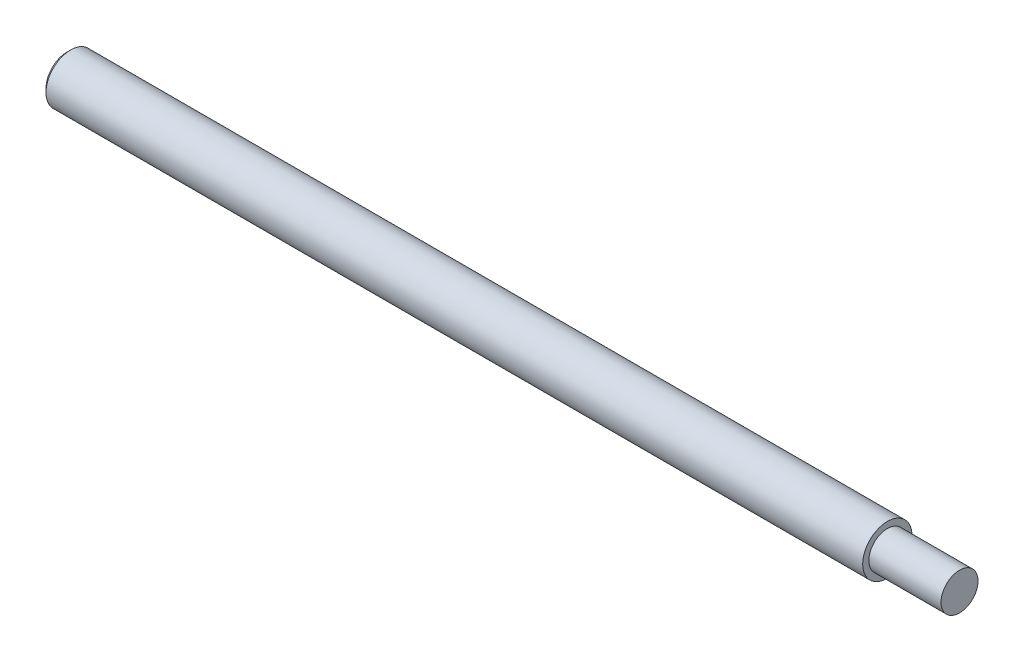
ISO-10303-21;
HEADER;
FILE_DESCRIPTION(('STEP AP214'),'2;1');
FILE_NAME('part.step','',(''),(''),'','','');
FILE_SCHEMA(('AUTOMOTIVE_DESIGN { 1 0 10303 214 1 1 1 1 }'));
ENDSEC;
DATA;
#1=APPLICATION_CONTEXT('core data for automotive mechanical design processes');
#2=APPLICATION_PROTOCOL_DEFINITION('international standard','automotive_design',2000,#1);
#3=PRODUCT_CONTEXT('',#1,'mechanical');
#4=PRODUCT('Part','Part','',(#3));
#5=PRODUCT_RELATED_PRODUCT_CATEGORY('part','',(#4));
#6=PRODUCT_DEFINITION_FORMATION('','',#4);
#7=PRODUCT_DEFINITION_CONTEXT('part definition',#1,'design');
#8=PRODUCT_DEFINITION('design','',#6,#7);
#9=PRODUCT_DEFINITION_SHAPE('','',#8);
#10=(LENGTH_UNIT() NAMED_UNIT(*) SI_UNIT(.MILLI.,.METRE.));
#11=(NAMED_UNIT(*) PLANE_ANGLE_UNIT() SI_UNIT($,.RADIAN.));
#12=(NAMED_UNIT(*) SI_UNIT($,.STERADIAN.) SOLID_ANGLE_UNIT());
#13=UNCERTAINTY_MEASURE_WITH_UNIT(LENGTH_MEASURE(1.E-05),#10,'distance_accuracy_value','');
#14=(GEOMETRIC_REPRESENTATION_CONTEXT(3) GLOBAL_UNCERTAINTY_ASSIGNED_CONTEXT((#13)) GLOBAL_UNIT_ASSIGNED_CONTEXT((#10,
#11,#12)) REPRESENTATION_CONTEXT('',''));
#15=CARTESIAN_POINT('',(0.,0.,0.));
#16=DIRECTION('',(0.,0.,1.));
#17=DIRECTION('',(1.,0.,0.));
#18=AXIS2_PLACEMENT_3D('',#15,#16,#17);
#19=CARTESIAN_POINT('',(0.,0.,0.));
#20=DIRECTION('',(1.,0.,0.));
#21=DIRECTION('',(0.,0.,-1.));
#22=AXIS2_PLACEMENT_3D('',#19,#20,#21);
#23=PLANE('',#22);
#24=CARTESIAN_POINT('',(0.,0.,0.));
#25=DIRECTION('',(1.,0.,0.));
#26=DIRECTION('',(0.,0.,-1.));
#27=AXIS2_PLACEMENT_3D('',#24,#25,#26);
#28=CIRCLE('',#27,17.);
#29=CARTESIAN_POINT('',(0.,0.,-17.));
#30=VERTEX_POINT('',#29);
#31=EDGE_CURVE('E34',#30,#30,#28,.F.);
#32=ORIENTED_EDGE('',*,*,#31,.T.);
#33=EDGE_LOOP('',(#32));
#34=FACE_BOUND('',#33,.T.);
#35=ADVANCED_FACE('F28',(#34),#23,.F.);
#36=CARTESIAN_POINT('',(0.,0.,0.));
#37=DIRECTION('',(-1.,0.,0.));
#38=DIRECTION('',(0.,0.,1.));
#39=AXIS2_PLACEMENT_3D('',#36,#37,#38);
#40=CYLINDRICAL_SURFACE('',#39,20.);
#41=CARTESIAN_POINT('',(3.00000000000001,0.,0.));
#42=DIRECTION('',(1.,0.,0.));
#43=DIRECTION('',(0.,0.,-1.));
#44=AXIS2_PLACEMENT_3D('',#41,#42,#43);
#45=CIRCLE('',#44,20.);
#46=CARTESIAN_POINT('',(3.00000000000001,0.,-20.));
#47=VERTEX_POINT('',#46);
#48=EDGE_CURVE('E10',#47,#47,#45,.T.);
#49=ORIENTED_EDGE('',*,*,#48,.T.);
#50=EDGE_LOOP('',(#49));
#51=FACE_BOUND('',#50,.T.);
#52=CARTESIAN_POINT('',(665.,0.,0.));
#53=DIRECTION('',(-1.,0.,0.));
#54=DIRECTION('',(0.,0.,1.));
#55=AXIS2_PLACEMENT_3D('',#52,#53,#54);
#56=CIRCLE('',#55,20.);
#57=CARTESIAN_POINT('',(665.,0.,20.));
#58=VERTEX_POINT('',#57);
#59=EDGE_CURVE('E38',#58,#58,#56,.T.);
#60=ORIENTED_EDGE('',*,*,#59,.T.);
#61=EDGE_LOOP('',(#60));
#62=FACE_BOUND('',#61,.T.);
#63=ADVANCED_FACE('F67',(#51,#62),#40,.T.);
#64=CARTESIAN_POINT('',(665.,20.,0.));
#65=DIRECTION('',(-1.,0.,0.));
#66=DIRECTION('',(0.,0.,1.));
#67=AXIS2_PLACEMENT_3D('',#64,#65,#66);
#68=PLANE('',#67);
#69=ORIENTED_EDGE('',*,*,#59,.F.);
#70=EDGE_LOOP('',(#69));
#71=FACE_BOUND('',#70,.T.);
#72=CARTESIAN_POINT('',(665.,0.,0.));
#73=DIRECTION('',(-1.,0.,0.));
#74=DIRECTION('',(0.,0.,1.));
#75=AXIS2_PLACEMENT_3D('',#72,#73,#74);
#76=CIRCLE('',#75,15.);
#77=CARTESIAN_POINT('',(665.,0.,15.));
#78=VERTEX_POINT('',#77);
#79=EDGE_CURVE('E42',#78,#78,#76,.T.);
#80=ORIENTED_EDGE('',*,*,#79,.T.);
#81=EDGE_LOOP('',(#80));
#82=FACE_BOUND('',#81,.T.);
#83=ADVANCED_FACE('F64',(#71,#82),#68,.F.);
#84=CARTESIAN_POINT('',(0.,0.,0.));
#85=DIRECTION('',(-1.,0.,0.));
#86=DIRECTION('',(0.,0.,1.));
#87=AXIS2_PLACEMENT_3D('',#84,#85,#86);
#88=CYLINDRICAL_SURFACE('',#87,15.);
#89=ORIENTED_EDGE('',*,*,#79,.F.);
#90=EDGE_LOOP('',(#89));
#91=FACE_BOUND('',#90,.T.);
#92=CARTESIAN_POINT('',(723.5,0.,0.));
#93=DIRECTION('',(-1.,0.,0.));
#94=DIRECTION('',(0.,0.,1.));
#95=AXIS2_PLACEMENT_3D('',#92,#93,#94);
#96=CIRCLE('',#95,15.);
#97=CARTESIAN_POINT('',(723.5,0.,15.));
#98=VERTEX_POINT('',#97);
#99=EDGE_CURVE('E47',#98,#98,#96,.T.);
#100=ORIENTED_EDGE('',*,*,#99,.T.);
#101=EDGE_LOOP('',(#100));
#102=FACE_BOUND('',#101,.T.);
#103=ADVANCED_FACE('F51',(#91,#102),#88,.T.);
#104=CARTESIAN_POINT('',(723.5,15.,0.));
#105=DIRECTION('',(-1.,0.,0.));
#106=DIRECTION('',(0.,0.,1.));
#107=AXIS2_PLACEMENT_3D('',#104,#105,#106);
#108=PLANE('',#107);
#109=ORIENTED_EDGE('',*,*,#99,.F.);
#110=EDGE_LOOP('',(#109));
#111=FACE_BOUND('',#110,.T.);
#112=ADVANCED_FACE('F53',(#111),#108,.F.);
#113=CARTESIAN_POINT('',(0.,0.,0.));
#114=DIRECTION('',(1.,0.,0.));
#115=DIRECTION('',(0.,0.,-1.));
#116=AXIS2_PLACEMENT_3D('',#113,#114,#115);
#117=CONICAL_SURFACE('',#116,17.,0.785398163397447);
#118=CARTESIAN_POINT('',(3.00000000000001,0.,-20.));
#119=CARTESIAN_POINT('',(2.96875000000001,0.,-19.96875));
#120=CARTESIAN_POINT('',(2.93750000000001,0.,-19.9375));
#121=CARTESIAN_POINT('',(2.87500000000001,0.,-19.875));
#122=CARTESIAN_POINT('',(2.84375000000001,0.,-19.84375));
#123=CARTESIAN_POINT('',(2.78125000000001,0.,-19.78125));
#124=CARTESIAN_POINT('',(2.75000000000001,0.,-19.75));
#125=CARTESIAN_POINT('',(2.68750000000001,0.,-19.6875));
#126=CARTESIAN_POINT('',(2.65625000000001,0.,-19.65625));
#127=CARTESIAN_POINT('',(2.59375000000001,0.,-19.59375));
#128=CARTESIAN_POINT('',(2.56250000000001,0.,-19.5625));
#129=CARTESIAN_POINT('',(2.50000000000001,0.,-19.5));
#130=CARTESIAN_POINT('',(2.46875000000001,0.,-19.46875));
#131=CARTESIAN_POINT('',(2.40625000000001,0.,-19.40625));
#132=CARTESIAN_POINT('',(2.37500000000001,0.,-19.375));
#133=CARTESIAN_POINT('',(2.31250000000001,0.,-19.3125));
#134=CARTESIAN_POINT('',(2.28125000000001,0.,-19.28125));
#135=CARTESIAN_POINT('',(2.21875000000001,0.,-19.21875));
#136=CARTESIAN_POINT('',(2.18750000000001,0.,-19.1875));
#137=CARTESIAN_POINT('',(2.12500000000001,0.,-19.125));
#138=CARTESIAN_POINT('',(2.09375000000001,0.,-19.09375));
#139=CARTESIAN_POINT('',(2.03125000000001,0.,-19.03125));
#140=CARTESIAN_POINT('',(2.00000000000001,0.,-19.));
#141=CARTESIAN_POINT('',(1.93750000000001,0.,-18.9375));
#142=CARTESIAN_POINT('',(1.90625000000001,0.,-18.90625));
#143=CARTESIAN_POINT('',(1.84375000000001,0.,-18.84375));
#144=CARTESIAN_POINT('',(1.81250000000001,0.,-18.8125));
#145=CARTESIAN_POINT('',(1.75000000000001,0.,-18.75));
#146=CARTESIAN_POINT('',(1.71875,0.,-18.71875));
#147=CARTESIAN_POINT('',(1.65625,0.,-18.65625));
#148=CARTESIAN_POINT('',(1.625,0.,-18.625));
#149=CARTESIAN_POINT('',(1.5625,0.,-18.5625));
#150=CARTESIAN_POINT('',(1.53125,0.,-18.53125));
#151=CARTESIAN_POINT('',(1.46875,0.,-18.46875));
#152=CARTESIAN_POINT('',(1.4375,0.,-18.4375));
#153=CARTESIAN_POINT('',(1.375,0.,-18.375));
#154=CARTESIAN_POINT('',(1.34375,0.,-18.34375));
#155=CARTESIAN_POINT('',(1.28125,0.,-18.28125));
#156=CARTESIAN_POINT('',(1.25,0.,-18.25));
#157=CARTESIAN_POINT('',(1.1875,0.,-18.1875));
#158=CARTESIAN_POINT('',(1.15625,0.,-18.15625));
#159=CARTESIAN_POINT('',(1.09375,0.,-18.09375));
#160=CARTESIAN_POINT('',(1.0625,0.,-18.0625));
#161=CARTESIAN_POINT('',(1.,0.,-18.));
#162=CARTESIAN_POINT('',(0.968750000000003,0.,-17.96875));
#163=CARTESIAN_POINT('',(0.906250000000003,0.,-17.90625));
#164=CARTESIAN_POINT('',(0.875000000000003,0.,-17.875));
#165=CARTESIAN_POINT('',(0.812500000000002,0.,-17.8125));
#166=CARTESIAN_POINT('',(0.781250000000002,0.,-17.78125));
#167=CARTESIAN_POINT('',(0.718750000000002,0.,-17.71875));
#168=CARTESIAN_POINT('',(0.687500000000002,0.,-17.6875));
#169=CARTESIAN_POINT('',(0.625000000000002,0.,-17.625));
#170=CARTESIAN_POINT('',(0.593750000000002,0.,-17.59375));
#171=CARTESIAN_POINT('',(0.531250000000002,0.,-17.53125));
#172=CARTESIAN_POINT('',(0.500000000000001,0.,-17.5));
#173=CARTESIAN_POINT('',(0.437500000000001,0.,-17.4375));
#174=CARTESIAN_POINT('',(0.406250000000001,0.,-17.40625));
#175=CARTESIAN_POINT('',(0.343750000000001,0.,-17.34375));
#176=CARTESIAN_POINT('',(0.312500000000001,0.,-17.3125));
#177=CARTESIAN_POINT('',(0.250000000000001,0.,-17.25));
#178=CARTESIAN_POINT('',(0.218750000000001,0.,-17.21875));
#179=CARTESIAN_POINT('',(0.15625,0.,-17.15625));
#180=CARTESIAN_POINT('',(0.125,0.,-17.125));
#181=CARTESIAN_POINT('',(0.0625,0.,-17.0625));
#182=CARTESIAN_POINT('',(0.03125,0.,-17.03125));
#183=CARTESIAN_POINT('',(0.,0.,-17.));
#184=B_SPLINE_CURVE_WITH_KNOTS('',3,(#118,#119,#120,#121,#122,#123,#124,#125,#126,#127,#128,
#129,#130,#131,#132,#133,#134,#135,#136,#137,#138,#139,#140,#141,#142,#143,#144,#145,#146,#147,
#148,#149,#150,#151,#152,#153,#154,#155,#156,#157,#158,#159,#160,#161,#162,#163,#164,#165,#166,
#167,#168,#169,#170,#171,#172,#173,#174,#175,#176,#177,#178,#179,#180,#181,#182,#183),
.UNSPECIFIED.,.F.,.F.,(4,2,2,2,2,2,2,2,2,2,2,2,2,2,2,2,2,2,2,2,2,2,2,2,2,2,2,2,2,2,2,2,4),(0.,
0.132582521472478,0.265165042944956,0.397747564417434,0.530330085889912,0.66291260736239,
0.795495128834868,0.928077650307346,1.06066017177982,1.1932426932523,1.32582521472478,
1.45840773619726,1.59099025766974,1.72357277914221,1.85615530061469,1.98873782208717,
2.12132034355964,2.25390286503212,2.3864853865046,2.51906790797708,2.65165042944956,
2.78423295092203,2.91681547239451,3.04939799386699,3.18198051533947,3.31456303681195,
3.44714555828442,3.5797280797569,3.71231060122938,3.84489312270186,3.97747564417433,
4.11005816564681,4.24264068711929),.UNSPECIFIED.);
#185=EDGE_CURVE('BSEAM55',#47,#30,#184,.T.);
#186=ORIENTED_EDGE('',*,*,#48,.F.);
#187=ORIENTED_EDGE('',*,*,#31,.F.);
#188=ORIENTED_EDGE('',*,*,#185,.T.);
#189=ORIENTED_EDGE('',*,*,#185,.F.);
#190=EDGE_LOOP('',(#186,#188,#187,#189));
#191=FACE_BOUND('',#190,.T.);
#192=ADVANCED_FACE('F55',(#191),#117,.T.);
#193=CLOSED_SHELL('',(#35,#63,#83,#103,#112,#192));
#194=MANIFOLD_SOLID_BREP('B2',#193);
#195=ADVANCED_BREP_SHAPE_REPRESENTATION('',(#18,#194),#14);
#196=SHAPE_DEFINITION_REPRESENTATION(#9,#195);
ENDSEC;
END-ISO-10303-21;
